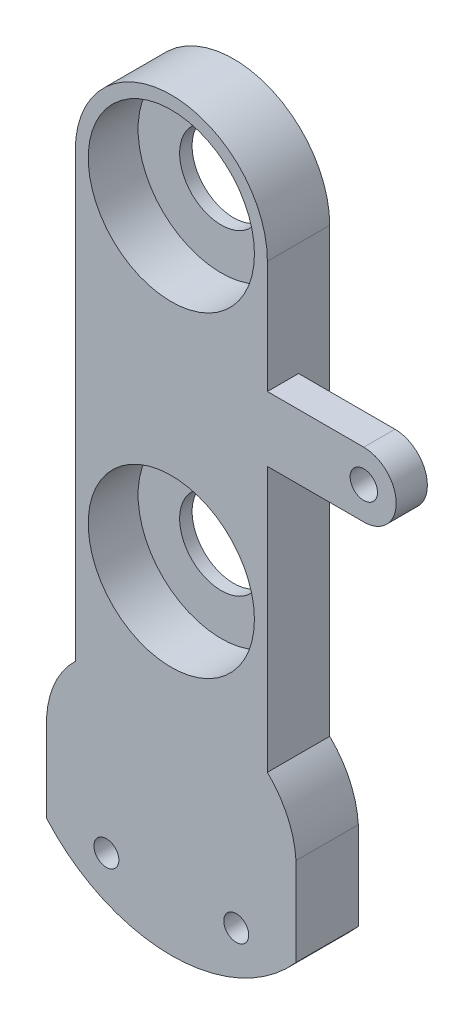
ISO-10303-21;
HEADER;
FILE_DESCRIPTION(('STEP AP214'),'2;1');
FILE_NAME('part.step','',(''),(''),'','','');
FILE_SCHEMA(('AUTOMOTIVE_DESIGN { 1 0 10303 214 1 1 1 1 }'));
ENDSEC;
DATA;
#1=APPLICATION_CONTEXT('core data for automotive mechanical design processes');
#2=APPLICATION_PROTOCOL_DEFINITION('international standard','automotive_design',2000,#1);
#3=PRODUCT_CONTEXT('',#1,'mechanical');
#4=PRODUCT('Part','Part','',(#3));
#5=PRODUCT_RELATED_PRODUCT_CATEGORY('part','',(#4));
#6=PRODUCT_DEFINITION_FORMATION('','',#4);
#7=PRODUCT_DEFINITION_CONTEXT('part definition',#1,'design');
#8=PRODUCT_DEFINITION('design','',#6,#7);
#9=PRODUCT_DEFINITION_SHAPE('','',#8);
#10=(LENGTH_UNIT() NAMED_UNIT(*) SI_UNIT(.MILLI.,.METRE.));
#11=(NAMED_UNIT(*) PLANE_ANGLE_UNIT() SI_UNIT($,.RADIAN.));
#12=(NAMED_UNIT(*) SI_UNIT($,.STERADIAN.) SOLID_ANGLE_UNIT());
#13=UNCERTAINTY_MEASURE_WITH_UNIT(LENGTH_MEASURE(1.E-05),#10,'distance_accuracy_value','');
#14=(GEOMETRIC_REPRESENTATION_CONTEXT(3) GLOBAL_UNCERTAINTY_ASSIGNED_CONTEXT((#13)) GLOBAL_UNIT_ASSIGNED_CONTEXT((#10,
#11,#12)) REPRESENTATION_CONTEXT('',''));
#15=CARTESIAN_POINT('',(0.,0.,0.));
#16=DIRECTION('',(0.,0.,1.));
#17=DIRECTION('',(1.,0.,0.));
#18=AXIS2_PLACEMENT_3D('',#15,#16,#17);
#19=CARTESIAN_POINT('',(76.325635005,99.9564099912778,15.));
#20=DIRECTION('',(0.,-1.,0.));
#21=DIRECTION('',(0.,0.,-1.));
#22=AXIS2_PLACEMENT_3D('',#19,#20,#21);
#23=PLANE('',#22);
#24=DIRECTION('',(0.,0.,-1.));
#25=VECTOR('',#24,1.);
#26=CARTESIAN_POINT('',(53.126816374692,99.9564099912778,15.));
#27=LINE('',#26,#25);
#28=CARTESIAN_POINT('',(53.126816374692,99.9564099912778,15.));
#29=VERTEX_POINT('',#28);
#30=CARTESIAN_POINT('',(53.126816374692,99.9564099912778,7.5));
#31=VERTEX_POINT('',#30);
#32=EDGE_CURVE('E266',#29,#31,#27,.T.);
#33=ORIENTED_EDGE('',*,*,#32,.T.);
#34=DIRECTION('',(-1.,0.,0.));
#35=VECTOR('',#34,1.);
#36=CARTESIAN_POINT('',(22.6023044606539,99.9564099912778,7.5));
#37=LINE('',#36,#35);
#38=CARTESIAN_POINT('',(76.325635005,99.9564099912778,7.5));
#39=VERTEX_POINT('',#38);
#40=EDGE_CURVE('E348',#39,#31,#37,.T.);
#41=ORIENTED_EDGE('',*,*,#40,.F.);
#42=DIRECTION('',(0.,0.,-1.));
#43=VECTOR('',#42,1.);
#44=CARTESIAN_POINT('',(76.325635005,99.9564099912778,15.));
#45=LINE('',#44,#43);
#46=CARTESIAN_POINT('',(76.325635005,99.9564099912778,15.));
#47=VERTEX_POINT('',#46);
#48=EDGE_CURVE('E263',#47,#39,#45,.T.);
#49=ORIENTED_EDGE('',*,*,#48,.F.);
#50=DIRECTION('',(-1.,0.,0.));
#51=VECTOR('',#50,1.);
#52=CARTESIAN_POINT('',(76.325635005,99.9564099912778,15.));
#53=LINE('',#52,#51);
#54=EDGE_CURVE('E335',#47,#29,#53,.T.);
#55=ORIENTED_EDGE('',*,*,#54,.T.);
#56=EDGE_LOOP('',(#33,#41,#49,#55));
#57=FACE_BOUND('',#56,.T.);
#58=ADVANCED_FACE('F123',(#57),#23,.T.);
#59=CARTESIAN_POINT('',(76.325635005,107.753585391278,15.));
#60=DIRECTION('',(0.,0.,-1.));
#61=DIRECTION('',(-1.,0.,0.));
#62=AXIS2_PLACEMENT_3D('',#59,#60,#61);
#63=CYLINDRICAL_SURFACE('',#62,7.7971754);
#64=CARTESIAN_POINT('',(76.325635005,107.753585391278,7.5));
#65=DIRECTION('',(0.,0.,-1.));
#66=DIRECTION('',(-1.,0.,0.));
#67=AXIS2_PLACEMENT_3D('',#64,#65,#66);
#68=CIRCLE('',#67,7.7971754);
#69=CARTESIAN_POINT('',(76.325635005,115.550760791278,7.5));
#70=VERTEX_POINT('',#69);
#71=EDGE_CURVE('E349',#70,#39,#68,.T.);
#72=ORIENTED_EDGE('',*,*,#71,.F.);
#73=DIRECTION('',(0.,0.,-1.));
#74=VECTOR('',#73,1.);
#75=CARTESIAN_POINT('',(76.325635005,115.550760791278,15.));
#76=LINE('',#75,#74);
#77=CARTESIAN_POINT('',(76.325635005,115.550760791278,15.));
#78=VERTEX_POINT('',#77);
#79=EDGE_CURVE('E234',#78,#70,#76,.T.);
#80=ORIENTED_EDGE('',*,*,#79,.F.);
#81=CARTESIAN_POINT('',(76.325635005,107.753585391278,15.));
#82=DIRECTION('',(0.,0.,1.));
#83=DIRECTION('',(1.,0.,0.));
#84=AXIS2_PLACEMENT_3D('',#81,#82,#83);
#85=CIRCLE('',#84,7.7971754);
#86=EDGE_CURVE('E221',#47,#78,#85,.T.);
#87=ORIENTED_EDGE('',*,*,#86,.F.);
#88=ORIENTED_EDGE('',*,*,#48,.T.);
#89=EDGE_LOOP('',(#72,#80,#87,#88));
#90=FACE_BOUND('',#89,.T.);
#91=ADVANCED_FACE('F377',(#90),#63,.T.);
#92=CARTESIAN_POINT('',(76.325635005,115.550760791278,15.));
#93=DIRECTION('',(-0.000300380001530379,-0.999999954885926,0.));
#94=DIRECTION('',(0.999999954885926,-0.00030038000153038,0.));
#95=AXIS2_PLACEMENT_3D('',#92,#93,#94);
#96=PLANE('',#95);
#97=DIRECTION('',(0.999999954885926,-0.00030038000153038,0.));
#98=VECTOR('',#97,1.);
#99=CARTESIAN_POINT('',(22.6310432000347,115.566889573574,7.5));
#100=LINE('',#99,#98);
#101=CARTESIAN_POINT('',(53.126816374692,115.557729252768,7.5));
#102=VERTEX_POINT('',#101);
#103=EDGE_CURVE('E231',#102,#70,#100,.T.);
#104=ORIENTED_EDGE('',*,*,#103,.F.);
#105=DIRECTION('',(0.,0.,-1.));
#106=VECTOR('',#105,1.);
#107=CARTESIAN_POINT('',(53.126816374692,115.557729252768,15.));
#108=LINE('',#107,#106);
#109=CARTESIAN_POINT('',(53.126816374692,115.557729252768,15.));
#110=VERTEX_POINT('',#109);
#111=EDGE_CURVE('E228',#110,#102,#108,.T.);
#112=ORIENTED_EDGE('',*,*,#111,.F.);
#113=DIRECTION('',(-0.999999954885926,0.00030038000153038,0.));
#114=VECTOR('',#113,1.);
#115=CARTESIAN_POINT('',(76.325635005,115.550760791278,15.));
#116=LINE('',#115,#114);
#117=EDGE_CURVE('E213',#78,#110,#116,.T.);
#118=ORIENTED_EDGE('',*,*,#117,.F.);
#119=ORIENTED_EDGE('',*,*,#79,.T.);
#120=EDGE_LOOP('',(#104,#112,#118,#119));
#121=FACE_BOUND('',#120,.T.);
#122=ADVANCED_FACE('F229',(#121),#96,.F.);
#123=CARTESIAN_POINT('',(22.6023044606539,19.892284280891,15.));
#124=DIRECTION('',(0.,0.,-1.));
#125=DIRECTION('',(-1.,0.,0.));
#126=AXIS2_PLACEMENT_3D('',#123,#124,#125);
#127=PLANE('',#126);
#128=CARTESIAN_POINT('',(76.325635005,107.753585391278,15.));
#129=DIRECTION('',(0.,0.,-1.));
#130=DIRECTION('',(-1.,0.,0.));
#131=AXIS2_PLACEMENT_3D('',#128,#129,#130);
#132=CIRCLE('',#131,3.3);
#133=CARTESIAN_POINT('',(73.025635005,107.753585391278,15.));
#134=VERTEX_POINT('',#133);
#135=EDGE_CURVE('E354',#134,#134,#132,.T.);
#136=ORIENTED_EDGE('',*,*,#135,.T.);
#137=EDGE_LOOP('',(#136));
#138=FACE_BOUND('',#137,.T.);
#139=CARTESIAN_POINT('',(30.006144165,142.699071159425,15.));
#140=DIRECTION('',(0.,0.,1.));
#141=DIRECTION('',(1.,0.,0.));
#142=AXIS2_PLACEMENT_3D('',#139,#140,#141);
#143=CIRCLE('',#142,20.);
#144=CARTESIAN_POINT('',(50.006144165,142.699071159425,15.));
#145=VERTEX_POINT('',#144);
#146=EDGE_CURVE('E302',#145,#145,#143,.T.);
#147=ORIENTED_EDGE('',*,*,#146,.F.);
#148=EDGE_LOOP('',(#147));
#149=FACE_BOUND('',#148,.T.);
#150=CARTESIAN_POINT('',(30.006144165,66.4990711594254,15.));
#151=DIRECTION('',(0.,0.,1.));
#152=DIRECTION('',(1.,0.,0.));
#153=AXIS2_PLACEMENT_3D('',#150,#151,#152);
#154=CIRCLE('',#153,20.);
#155=CARTESIAN_POINT('',(50.006144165,66.4990711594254,15.));
#156=VERTEX_POINT('',#155);
#157=EDGE_CURVE('E305',#156,#156,#154,.T.);
#158=ORIENTED_EDGE('',*,*,#157,.F.);
#159=EDGE_LOOP('',(#158));
#160=FACE_BOUND('',#159,.T.);
#161=CARTESIAN_POINT('',(45.631144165,0.,15.));
#162=DIRECTION('',(0.,0.,-1.));
#163=DIRECTION('',(-1.,0.,0.));
#164=AXIS2_PLACEMENT_3D('',#161,#162,#163);
#165=CIRCLE('',#164,2.99999999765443);
#166=CARTESIAN_POINT('',(42.6311441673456,0.,15.));
#167=VERTEX_POINT('',#166);
#168=EDGE_CURVE('E310',#167,#167,#165,.T.);
#169=ORIENTED_EDGE('',*,*,#168,.T.);
#170=EDGE_LOOP('',(#169));
#171=FACE_BOUND('',#170,.T.);
#172=DIRECTION('',(0.,-1.,0.));
#173=VECTOR('',#172,1.);
#174=CARTESIAN_POINT('',(6.88547195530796,142.699071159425,15.));
#175=LINE('',#174,#173);
#176=CARTESIAN_POINT('',(6.88547195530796,142.699071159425,15.));
#177=VERTEX_POINT('',#176);
#178=CARTESIAN_POINT('',(6.88547195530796,36.1909692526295,15.));
#179=VERTEX_POINT('',#178);
#180=EDGE_CURVE('E184',#177,#179,#175,.T.);
#181=ORIENTED_EDGE('',*,*,#180,.T.);
#182=CARTESIAN_POINT('',(22.6023044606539,19.892284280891,15.));
#183=DIRECTION('',(0.,0.,-1.));
#184=DIRECTION('',(-1.,0.,0.));
#185=AXIS2_PLACEMENT_3D('',#182,#183,#184);
#186=CIRCLE('',#185,22.642127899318);
#187=CARTESIAN_POINT('',(0.,21.2345915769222,15.));
#188=VERTEX_POINT('',#187);
#189=EDGE_CURVE('E321',#188,#179,#186,.T.);
#190=ORIENTED_EDGE('',*,*,#189,.F.);
#191=DIRECTION('',(0.,1.,0.));
#192=VECTOR('',#191,1.);
#193=CARTESIAN_POINT('',(0.,0.,15.));
#194=LINE('',#193,#192);
#195=CARTESIAN_POINT('',(0.,0.,15.));
#196=VERTEX_POINT('',#195);
#197=EDGE_CURVE('E324',#196,#188,#194,.T.);
#198=ORIENTED_EDGE('',*,*,#197,.F.);
#199=CARTESIAN_POINT('',(30.006144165,26.4505446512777,15.));
#200=DIRECTION('',(0.,0.,1.));
#201=DIRECTION('',(1.,0.,0.));
#202=AXIS2_PLACEMENT_3D('',#199,#200,#201);
#203=CIRCLE('',#202,40.);
#204=CARTESIAN_POINT('',(60.01228833,0.,15.));
#205=VERTEX_POINT('',#204);
#206=EDGE_CURVE('E327',#196,#205,#203,.T.);
#207=ORIENTED_EDGE('',*,*,#206,.T.);
#208=DIRECTION('',(0.,1.,0.));
#209=VECTOR('',#208,1.);
#210=CARTESIAN_POINT('',(60.01228833,0.,15.));
#211=LINE('',#210,#209);
#212=CARTESIAN_POINT('',(60.01228833,21.2345915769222,15.));
#213=VERTEX_POINT('',#212);
#214=EDGE_CURVE('E329',#205,#213,#211,.T.);
#215=ORIENTED_EDGE('',*,*,#214,.T.);
#216=CARTESIAN_POINT('',(37.4099838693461,19.892284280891,15.));
#217=DIRECTION('',(0.,0.,1.));
#218=DIRECTION('',(1.,0.,0.));
#219=AXIS2_PLACEMENT_3D('',#216,#217,#218);
#220=CIRCLE('',#219,22.642127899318);
#221=CARTESIAN_POINT('',(53.126816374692,36.1909692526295,15.));
#222=VERTEX_POINT('',#221);
#223=EDGE_CURVE('E331',#213,#222,#220,.T.);
#224=ORIENTED_EDGE('',*,*,#223,.T.);
#225=DIRECTION('',(0.,1.,0.));
#226=VECTOR('',#225,1.);
#227=CARTESIAN_POINT('',(53.126816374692,36.1909692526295,15.));
#228=LINE('',#227,#226);
#229=EDGE_CURVE('E333',#222,#29,#228,.T.);
#230=ORIENTED_EDGE('',*,*,#229,.T.);
#231=ORIENTED_EDGE('',*,*,#54,.F.);
#232=ORIENTED_EDGE('',*,*,#86,.T.);
#233=ORIENTED_EDGE('',*,*,#117,.T.);
#234=DIRECTION('',(0.,1.,0.));
#235=VECTOR('',#234,1.);
#236=CARTESIAN_POINT('',(53.126816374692,115.557729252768,15.));
#237=LINE('',#236,#235);
#238=CARTESIAN_POINT('',(53.126816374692,142.699071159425,15.));
#239=VERTEX_POINT('',#238);
#240=EDGE_CURVE('E218',#110,#239,#237,.T.);
#241=ORIENTED_EDGE('',*,*,#240,.T.);
#242=CARTESIAN_POINT('',(30.006144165,142.699071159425,15.));
#243=DIRECTION('',(0.,0.,-1.));
#244=DIRECTION('',(-1.,0.,0.));
#245=AXIS2_PLACEMENT_3D('',#242,#243,#244);
#246=CIRCLE('',#245,23.120672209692);
#247=EDGE_CURVE('E237',#177,#239,#246,.T.);
#248=ORIENTED_EDGE('',*,*,#247,.F.);
#249=EDGE_LOOP('',(#181,#190,#198,#207,#215,#224,#230,#231,#232,#233,#241,#248));
#250=FACE_BOUND('',#249,.T.);
#251=CARTESIAN_POINT('',(14.381144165,0.,15.));
#252=DIRECTION('',(0.,0.,1.));
#253=DIRECTION('',(1.,0.,0.));
#254=AXIS2_PLACEMENT_3D('',#251,#252,#253);
#255=CIRCLE('',#254,2.99999999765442);
#256=CARTESIAN_POINT('',(17.3811441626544,0.,15.));
#257=VERTEX_POINT('',#256);
#258=EDGE_CURVE('E244',#257,#257,#255,.T.);
#259=ORIENTED_EDGE('',*,*,#258,.F.);
#260=EDGE_LOOP('',(#259));
#261=FACE_BOUND('',#260,.T.);
#262=ADVANCED_FACE('F215',(#138,#149,#160,#171,#250,#261),#127,.F.);
#263=CARTESIAN_POINT('',(22.6023044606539,19.892284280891,0.));
#264=DIRECTION('',(0.,0.,-1.));
#265=DIRECTION('',(-1.,0.,0.));
#266=AXIS2_PLACEMENT_3D('',#263,#264,#265);
#267=PLANE('',#266);
#268=DIRECTION('',(0.,1.,0.));
#269=VECTOR('',#268,1.);
#270=CARTESIAN_POINT('',(53.126816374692,115.557729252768,0.));
#271=LINE('',#270,#269);
#272=CARTESIAN_POINT('',(53.126816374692,36.1909692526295,0.));
#273=VERTEX_POINT('',#272);
#274=CARTESIAN_POINT('',(53.126816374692,142.699071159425,0.));
#275=VERTEX_POINT('',#274);
#276=EDGE_CURVE('E256',#273,#275,#271,.T.);
#277=ORIENTED_EDGE('',*,*,#276,.F.);
#278=CARTESIAN_POINT('',(37.4099838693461,19.892284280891,0.));
#279=DIRECTION('',(0.,0.,1.));
#280=DIRECTION('',(1.,0.,0.));
#281=AXIS2_PLACEMENT_3D('',#278,#279,#280);
#282=CIRCLE('',#281,22.642127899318);
#283=CARTESIAN_POINT('',(60.01228833,21.2345915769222,0.));
#284=VERTEX_POINT('',#283);
#285=EDGE_CURVE('E253',#284,#273,#282,.T.);
#286=ORIENTED_EDGE('',*,*,#285,.F.);
#287=DIRECTION('',(0.,1.,0.));
#288=VECTOR('',#287,1.);
#289=CARTESIAN_POINT('',(60.01228833,0.,0.));
#290=LINE('',#289,#288);
#291=CARTESIAN_POINT('',(60.01228833,0.,0.));
#292=VERTEX_POINT('',#291);
#293=EDGE_CURVE('E251',#292,#284,#290,.T.);
#294=ORIENTED_EDGE('',*,*,#293,.F.);
#295=CARTESIAN_POINT('',(30.006144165,26.4505446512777,0.));
#296=DIRECTION('',(0.,0.,1.));
#297=DIRECTION('',(1.,0.,0.));
#298=AXIS2_PLACEMENT_3D('',#295,#296,#297);
#299=CIRCLE('',#298,40.);
#300=CARTESIAN_POINT('',(0.,0.,0.));
#301=VERTEX_POINT('',#300);
#302=EDGE_CURVE('E249',#301,#292,#299,.T.);
#303=ORIENTED_EDGE('',*,*,#302,.F.);
#304=DIRECTION('',(0.,1.,0.));
#305=VECTOR('',#304,1.);
#306=CARTESIAN_POINT('',(0.,0.,0.));
#307=LINE('',#306,#305);
#308=CARTESIAN_POINT('',(0.,21.2345915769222,0.));
#309=VERTEX_POINT('',#308);
#310=EDGE_CURVE('E246',#301,#309,#307,.T.);
#311=ORIENTED_EDGE('',*,*,#310,.T.);
#312=CARTESIAN_POINT('',(22.6023044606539,19.892284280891,0.));
#313=DIRECTION('',(0.,0.,-1.));
#314=DIRECTION('',(-1.,0.,0.));
#315=AXIS2_PLACEMENT_3D('',#312,#313,#314);
#316=CIRCLE('',#315,22.642127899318);
#317=CARTESIAN_POINT('',(6.88547195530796,36.1909692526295,0.));
#318=VERTEX_POINT('',#317);
#319=EDGE_CURVE('E243',#309,#318,#316,.T.);
#320=ORIENTED_EDGE('',*,*,#319,.T.);
#321=DIRECTION('',(0.,-1.,0.));
#322=VECTOR('',#321,1.);
#323=CARTESIAN_POINT('',(6.88547195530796,113.682673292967,0.));
#324=LINE('',#323,#322);
#325=CARTESIAN_POINT('',(6.88547195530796,142.699071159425,0.));
#326=VERTEX_POINT('',#325);
#327=EDGE_CURVE('E177',#326,#318,#324,.T.);
#328=ORIENTED_EDGE('',*,*,#327,.F.);
#329=CARTESIAN_POINT('',(30.006144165,142.699071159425,0.));
#330=DIRECTION('',(0.,0.,-1.));
#331=DIRECTION('',(-1.,0.,0.));
#332=AXIS2_PLACEMENT_3D('',#329,#330,#331);
#333=CIRCLE('',#332,23.120672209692);
#334=EDGE_CURVE('E258',#326,#275,#333,.T.);
#335=ORIENTED_EDGE('',*,*,#334,.T.);
#336=EDGE_LOOP('',(#277,#286,#294,#303,#311,#320,#328,#335));
#337=FACE_BOUND('',#336,.T.);
#338=CARTESIAN_POINT('',(30.006144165,142.699071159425,0.));
#339=DIRECTION('',(0.,0.,1.));
#340=DIRECTION('',(1.,0.,0.));
#341=AXIS2_PLACEMENT_3D('',#338,#339,#340);
#342=CIRCLE('',#341,10.);
#343=CARTESIAN_POINT('',(40.006144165,142.699071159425,0.));
#344=VERTEX_POINT('',#343);
#345=EDGE_CURVE('E282',#344,#344,#342,.T.);
#346=ORIENTED_EDGE('',*,*,#345,.T.);
#347=EDGE_LOOP('',(#346));
#348=FACE_BOUND('',#347,.T.);
#349=CARTESIAN_POINT('',(30.006144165,66.4990711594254,0.));
#350=DIRECTION('',(0.,0.,1.));
#351=DIRECTION('',(1.,0.,0.));
#352=AXIS2_PLACEMENT_3D('',#349,#350,#351);
#353=CIRCLE('',#352,10.);
#354=CARTESIAN_POINT('',(40.006144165,66.4990711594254,0.));
#355=VERTEX_POINT('',#354);
#356=EDGE_CURVE('E288',#355,#355,#353,.T.);
#357=ORIENTED_EDGE('',*,*,#356,.T.);
#358=EDGE_LOOP('',(#357));
#359=FACE_BOUND('',#358,.T.);
#360=CARTESIAN_POINT('',(45.631144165,0.,0.));
#361=DIRECTION('',(0.,0.,-1.));
#362=DIRECTION('',(-1.,0.,0.));
#363=AXIS2_PLACEMENT_3D('',#360,#361,#362);
#364=CIRCLE('',#363,2.99999999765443);
#365=CARTESIAN_POINT('',(42.6311441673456,0.,0.));
#366=VERTEX_POINT('',#365);
#367=EDGE_CURVE('E301',#366,#366,#364,.T.);
#368=ORIENTED_EDGE('',*,*,#367,.F.);
#369=EDGE_LOOP('',(#368));
#370=FACE_BOUND('',#369,.T.);
#371=CARTESIAN_POINT('',(14.381144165,0.,0.));
#372=DIRECTION('',(0.,0.,1.));
#373=DIRECTION('',(1.,0.,0.));
#374=AXIS2_PLACEMENT_3D('',#371,#372,#373);
#375=CIRCLE('',#374,2.99999999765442);
#376=CARTESIAN_POINT('',(17.3811441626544,0.,0.));
#377=VERTEX_POINT('',#376);
#378=EDGE_CURVE('E313',#377,#377,#375,.T.);
#379=ORIENTED_EDGE('',*,*,#378,.T.);
#380=EDGE_LOOP('',(#379));
#381=FACE_BOUND('',#380,.T.);
#382=ADVANCED_FACE('F410',(#337,#348,#359,#370,#381),#267,.T.);
#383=CARTESIAN_POINT('',(6.88547195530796,113.682673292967,15.));
#384=DIRECTION('',(1.,0.,0.));
#385=DIRECTION('',(0.,0.,-1.));
#386=AXIS2_PLACEMENT_3D('',#383,#384,#385);
#387=PLANE('',#386);
#388=ORIENTED_EDGE('',*,*,#327,.T.);
#389=DIRECTION('',(0.,0.,-1.));
#390=VECTOR('',#389,1.);
#391=CARTESIAN_POINT('',(6.88547195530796,36.1909692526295,15.));
#392=LINE('',#391,#390);
#393=EDGE_CURVE('E12',#179,#318,#392,.T.);
#394=ORIENTED_EDGE('',*,*,#393,.F.);
#395=ORIENTED_EDGE('',*,*,#180,.F.);
#396=DIRECTION('',(0.,0.,-1.));
#397=VECTOR('',#396,1.);
#398=CARTESIAN_POINT('',(6.88547195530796,142.699071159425,15.));
#399=LINE('',#398,#397);
#400=EDGE_CURVE('E142',#177,#326,#399,.T.);
#401=ORIENTED_EDGE('',*,*,#400,.T.);
#402=EDGE_LOOP('',(#388,#394,#395,#401));
#403=FACE_BOUND('',#402,.T.);
#404=ADVANCED_FACE('F125',(#403),#387,.F.);
#405=CARTESIAN_POINT('',(22.6023044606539,19.892284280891,15.));
#406=DIRECTION('',(0.,0.,-1.));
#407=DIRECTION('',(-1.,0.,0.));
#408=AXIS2_PLACEMENT_3D('',#405,#406,#407);
#409=CYLINDRICAL_SURFACE('',#408,22.642127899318);
#410=ORIENTED_EDGE('',*,*,#319,.F.);
#411=DIRECTION('',(0.,0.,-1.));
#412=VECTOR('',#411,1.);
#413=CARTESIAN_POINT('',(0.,21.2345915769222,15.));
#414=LINE('',#413,#412);
#415=EDGE_CURVE('E133',#188,#309,#414,.T.);
#416=ORIENTED_EDGE('',*,*,#415,.F.);
#417=ORIENTED_EDGE('',*,*,#189,.T.);
#418=ORIENTED_EDGE('',*,*,#393,.T.);
#419=EDGE_LOOP('',(#410,#416,#417,#418));
#420=FACE_BOUND('',#419,.T.);
#421=ADVANCED_FACE('F403',(#420),#409,.T.);
#422=CARTESIAN_POINT('',(0.,0.,15.));
#423=DIRECTION('',(-1.,0.,0.));
#424=DIRECTION('',(0.,-1.,0.));
#425=AXIS2_PLACEMENT_3D('',#422,#423,#424);
#426=PLANE('',#425);
#427=ORIENTED_EDGE('',*,*,#310,.F.);
#428=DIRECTION('',(0.,0.,-1.));
#429=VECTOR('',#428,1.);
#430=CARTESIAN_POINT('',(0.,0.,15.));
#431=LINE('',#430,#429);
#432=EDGE_CURVE('E278',#196,#301,#431,.T.);
#433=ORIENTED_EDGE('',*,*,#432,.F.);
#434=ORIENTED_EDGE('',*,*,#197,.T.);
#435=ORIENTED_EDGE('',*,*,#415,.T.);
#436=EDGE_LOOP('',(#427,#433,#434,#435));
#437=FACE_BOUND('',#436,.T.);
#438=ADVANCED_FACE('F400',(#437),#426,.T.);
#439=CARTESIAN_POINT('',(30.006144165,26.4505446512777,15.));
#440=DIRECTION('',(0.,0.,-1.));
#441=DIRECTION('',(-1.,0.,0.));
#442=AXIS2_PLACEMENT_3D('',#439,#440,#441);
#443=CYLINDRICAL_SURFACE('',#442,40.);
#444=ORIENTED_EDGE('',*,*,#302,.T.);
#445=DIRECTION('',(0.,0.,-1.));
#446=VECTOR('',#445,1.);
#447=CARTESIAN_POINT('',(60.01228833,0.,15.));
#448=LINE('',#447,#446);
#449=EDGE_CURVE('E275',#205,#292,#448,.T.);
#450=ORIENTED_EDGE('',*,*,#449,.F.);
#451=ORIENTED_EDGE('',*,*,#206,.F.);
#452=ORIENTED_EDGE('',*,*,#432,.T.);
#453=EDGE_LOOP('',(#444,#450,#451,#452));
#454=FACE_BOUND('',#453,.T.);
#455=ADVANCED_FACE('F396',(#454),#443,.T.);
#456=CARTESIAN_POINT('',(60.01228833,0.,15.));
#457=DIRECTION('',(-1.,0.,0.));
#458=DIRECTION('',(0.,0.,1.));
#459=AXIS2_PLACEMENT_3D('',#456,#457,#458);
#460=PLANE('',#459);
#461=ORIENTED_EDGE('',*,*,#293,.T.);
#462=DIRECTION('',(0.,0.,-1.));
#463=VECTOR('',#462,1.);
#464=CARTESIAN_POINT('',(60.01228833,21.2345915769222,15.));
#465=LINE('',#464,#463);
#466=EDGE_CURVE('E272',#213,#284,#465,.T.);
#467=ORIENTED_EDGE('',*,*,#466,.F.);
#468=ORIENTED_EDGE('',*,*,#214,.F.);
#469=ORIENTED_EDGE('',*,*,#449,.T.);
#470=EDGE_LOOP('',(#461,#467,#468,#469));
#471=FACE_BOUND('',#470,.T.);
#472=ADVANCED_FACE('F392',(#471),#460,.F.);
#473=CARTESIAN_POINT('',(37.4099838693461,19.892284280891,15.));
#474=DIRECTION('',(0.,0.,-1.));
#475=DIRECTION('',(-1.,0.,0.));
#476=AXIS2_PLACEMENT_3D('',#473,#474,#475);
#477=CYLINDRICAL_SURFACE('',#476,22.642127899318);
#478=ORIENTED_EDGE('',*,*,#285,.T.);
#479=DIRECTION('',(0.,0.,-1.));
#480=VECTOR('',#479,1.);
#481=CARTESIAN_POINT('',(53.126816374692,36.1909692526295,15.));
#482=LINE('',#481,#480);
#483=EDGE_CURVE('E269',#222,#273,#482,.T.);
#484=ORIENTED_EDGE('',*,*,#483,.F.);
#485=ORIENTED_EDGE('',*,*,#223,.F.);
#486=ORIENTED_EDGE('',*,*,#466,.T.);
#487=EDGE_LOOP('',(#478,#484,#485,#486));
#488=FACE_BOUND('',#487,.T.);
#489=ADVANCED_FACE('F389',(#488),#477,.T.);
#490=CARTESIAN_POINT('',(53.126816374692,115.557729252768,15.));
#491=DIRECTION('',(-1.,0.,0.));
#492=DIRECTION('',(0.,-1.,0.));
#493=AXIS2_PLACEMENT_3D('',#490,#491,#492);
#494=PLANE('',#493);
#495=ORIENTED_EDGE('',*,*,#276,.T.);
#496=DIRECTION('',(0.,0.,-1.));
#497=VECTOR('',#496,1.);
#498=CARTESIAN_POINT('',(53.126816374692,142.699071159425,15.));
#499=LINE('',#498,#497);
#500=EDGE_CURVE('E169',#239,#275,#499,.T.);
#501=ORIENTED_EDGE('',*,*,#500,.F.);
#502=ORIENTED_EDGE('',*,*,#240,.F.);
#503=ORIENTED_EDGE('',*,*,#111,.T.);
#504=DIRECTION('',(0.,1.,0.));
#505=VECTOR('',#504,1.);
#506=CARTESIAN_POINT('',(53.126816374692,19.892284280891,7.5));
#507=LINE('',#506,#505);
#508=EDGE_CURVE('E293',#31,#102,#507,.T.);
#509=ORIENTED_EDGE('',*,*,#508,.F.);
#510=ORIENTED_EDGE('',*,*,#32,.F.);
#511=ORIENTED_EDGE('',*,*,#229,.F.);
#512=ORIENTED_EDGE('',*,*,#483,.T.);
#513=EDGE_LOOP('',(#495,#501,#502,#503,#509,#510,#511,#512));
#514=FACE_BOUND('',#513,.T.);
#515=ADVANCED_FACE('F236',(#514),#494,.F.);
#516=CARTESIAN_POINT('',(30.006144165,142.699071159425,15.));
#517=DIRECTION('',(0.,0.,-1.));
#518=DIRECTION('',(-1.,0.,0.));
#519=AXIS2_PLACEMENT_3D('',#516,#517,#518);
#520=CYLINDRICAL_SURFACE('',#519,23.120672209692);
#521=ORIENTED_EDGE('',*,*,#334,.F.);
#522=ORIENTED_EDGE('',*,*,#400,.F.);
#523=ORIENTED_EDGE('',*,*,#247,.T.);
#524=ORIENTED_EDGE('',*,*,#500,.T.);
#525=EDGE_LOOP('',(#521,#522,#523,#524));
#526=FACE_BOUND('',#525,.T.);
#527=ADVANCED_FACE('F422',(#526),#520,.T.);
#528=CARTESIAN_POINT('',(14.381144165,0.,15.));
#529=DIRECTION('',(0.,0.,-1.));
#530=DIRECTION('',(-1.,0.,0.));
#531=AXIS2_PLACEMENT_3D('',#528,#529,#530);
#532=CYLINDRICAL_SURFACE('',#531,2.99999999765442);
#533=ORIENTED_EDGE('',*,*,#258,.T.);
#534=EDGE_LOOP('',(#533));
#535=FACE_BOUND('',#534,.T.);
#536=ORIENTED_EDGE('',*,*,#378,.F.);
#537=EDGE_LOOP('',(#536));
#538=FACE_BOUND('',#537,.T.);
#539=ADVANCED_FACE('F424',(#535,#538),#532,.F.);
#540=CARTESIAN_POINT('',(45.631144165,0.,15.));
#541=DIRECTION('',(0.,0.,-1.));
#542=DIRECTION('',(-1.,0.,0.));
#543=AXIS2_PLACEMENT_3D('',#540,#541,#542);
#544=CYLINDRICAL_SURFACE('',#543,2.99999999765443);
#545=ORIENTED_EDGE('',*,*,#168,.F.);
#546=EDGE_LOOP('',(#545));
#547=FACE_BOUND('',#546,.T.);
#548=ORIENTED_EDGE('',*,*,#367,.T.);
#549=EDGE_LOOP('',(#548));
#550=FACE_BOUND('',#549,.T.);
#551=ADVANCED_FACE('F429',(#547,#550),#544,.F.);
#552=CARTESIAN_POINT('',(30.006144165,66.4990711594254,3.));
#553=DIRECTION('',(0.,0.,1.));
#554=DIRECTION('',(1.,0.,0.));
#555=AXIS2_PLACEMENT_3D('',#552,#553,#554);
#556=CYLINDRICAL_SURFACE('',#555,20.);
#557=CARTESIAN_POINT('',(30.006144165,66.4990711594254,3.));
#558=DIRECTION('',(0.,0.,1.));
#559=DIRECTION('',(1.,0.,0.));
#560=AXIS2_PLACEMENT_3D('',#557,#558,#559);
#561=CIRCLE('',#560,20.);
#562=CARTESIAN_POINT('',(50.006144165,66.4990711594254,3.));
#563=VERTEX_POINT('',#562);
#564=EDGE_CURVE('E286',#563,#563,#561,.T.);
#565=ORIENTED_EDGE('',*,*,#564,.F.);
#566=EDGE_LOOP('',(#565));
#567=FACE_BOUND('',#566,.T.);
#568=ORIENTED_EDGE('',*,*,#157,.T.);
#569=EDGE_LOOP('',(#568));
#570=FACE_BOUND('',#569,.T.);
#571=ADVANCED_FACE('F440',(#567,#570),#556,.F.);
#572=CARTESIAN_POINT('',(30.006144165,66.4990711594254,3.));
#573=DIRECTION('',(0.,0.,1.));
#574=DIRECTION('',(1.,0.,0.));
#575=AXIS2_PLACEMENT_3D('',#572,#573,#574);
#576=PLANE('',#575);
#577=CARTESIAN_POINT('',(30.006144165,66.4990711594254,3.));
#578=DIRECTION('',(0.,0.,1.));
#579=DIRECTION('',(1.,0.,0.));
#580=AXIS2_PLACEMENT_3D('',#577,#578,#579);
#581=CIRCLE('',#580,10.);
#582=CARTESIAN_POINT('',(40.006144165,66.4990711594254,3.));
#583=VERTEX_POINT('',#582);
#584=EDGE_CURVE('E127',#583,#583,#581,.T.);
#585=ORIENTED_EDGE('',*,*,#584,.F.);
#586=EDGE_LOOP('',(#585));
#587=FACE_BOUND('',#586,.T.);
#588=ORIENTED_EDGE('',*,*,#564,.T.);
#589=EDGE_LOOP('',(#588));
#590=FACE_BOUND('',#589,.T.);
#591=ADVANCED_FACE('F442',(#587,#590),#576,.T.);
#592=CARTESIAN_POINT('',(30.006144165,142.699071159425,3.));
#593=DIRECTION('',(0.,0.,1.));
#594=DIRECTION('',(1.,0.,0.));
#595=AXIS2_PLACEMENT_3D('',#592,#593,#594);
#596=CYLINDRICAL_SURFACE('',#595,20.);
#597=CARTESIAN_POINT('',(30.006144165,142.699071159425,3.));
#598=DIRECTION('',(0.,0.,1.));
#599=DIRECTION('',(1.,0.,0.));
#600=AXIS2_PLACEMENT_3D('',#597,#598,#599);
#601=CIRCLE('',#600,20.);
#602=CARTESIAN_POINT('',(50.006144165,142.699071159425,3.));
#603=VERTEX_POINT('',#602);
#604=EDGE_CURVE('E298',#603,#603,#601,.T.);
#605=ORIENTED_EDGE('',*,*,#604,.F.);
#606=EDGE_LOOP('',(#605));
#607=FACE_BOUND('',#606,.T.);
#608=ORIENTED_EDGE('',*,*,#146,.T.);
#609=EDGE_LOOP('',(#608));
#610=FACE_BOUND('',#609,.T.);
#611=ADVANCED_FACE('F445',(#607,#610),#596,.F.);
#612=CARTESIAN_POINT('',(30.006144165,142.699071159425,3.));
#613=DIRECTION('',(0.,0.,1.));
#614=DIRECTION('',(1.,0.,0.));
#615=AXIS2_PLACEMENT_3D('',#612,#613,#614);
#616=PLANE('',#615);
#617=CARTESIAN_POINT('',(30.006144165,142.699071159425,3.));
#618=DIRECTION('',(0.,0.,1.));
#619=DIRECTION('',(1.,0.,0.));
#620=AXIS2_PLACEMENT_3D('',#617,#618,#619);
#621=CIRCLE('',#620,10.);
#622=CARTESIAN_POINT('',(40.006144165,142.699071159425,3.));
#623=VERTEX_POINT('',#622);
#624=EDGE_CURVE('E280',#623,#623,#621,.T.);
#625=ORIENTED_EDGE('',*,*,#624,.F.);
#626=EDGE_LOOP('',(#625));
#627=FACE_BOUND('',#626,.T.);
#628=ORIENTED_EDGE('',*,*,#604,.T.);
#629=EDGE_LOOP('',(#628));
#630=FACE_BOUND('',#629,.T.);
#631=ADVANCED_FACE('F452',(#627,#630),#616,.T.);
#632=CARTESIAN_POINT('',(30.006144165,142.699071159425,0.));
#633=DIRECTION('',(0.,0.,1.));
#634=DIRECTION('',(1.,0.,0.));
#635=AXIS2_PLACEMENT_3D('',#632,#633,#634);
#636=CYLINDRICAL_SURFACE('',#635,10.);
#637=ORIENTED_EDGE('',*,*,#624,.T.);
#638=EDGE_LOOP('',(#637));
#639=FACE_BOUND('',#638,.T.);
#640=ORIENTED_EDGE('',*,*,#345,.F.);
#641=EDGE_LOOP('',(#640));
#642=FACE_BOUND('',#641,.T.);
#643=ADVANCED_FACE('F456',(#639,#642),#636,.F.);
#644=CARTESIAN_POINT('',(30.006144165,66.4990711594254,0.));
#645=DIRECTION('',(0.,0.,1.));
#646=DIRECTION('',(1.,0.,0.));
#647=AXIS2_PLACEMENT_3D('',#644,#645,#646);
#648=CYLINDRICAL_SURFACE('',#647,10.);
#649=ORIENTED_EDGE('',*,*,#584,.T.);
#650=EDGE_LOOP('',(#649));
#651=FACE_BOUND('',#650,.T.);
#652=ORIENTED_EDGE('',*,*,#356,.F.);
#653=EDGE_LOOP('',(#652));
#654=FACE_BOUND('',#653,.T.);
#655=ADVANCED_FACE('F371',(#651,#654),#648,.F.);
#656=CARTESIAN_POINT('',(76.325635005,107.753585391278,7.5));
#657=DIRECTION('',(0.,0.,-1.));
#658=DIRECTION('',(-1.,0.,0.));
#659=AXIS2_PLACEMENT_3D('',#656,#657,#658);
#660=PLANE('',#659);
#661=CARTESIAN_POINT('',(76.325635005,107.753585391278,7.5));
#662=DIRECTION('',(0.,0.,-1.));
#663=DIRECTION('',(-1.,0.,0.));
#664=AXIS2_PLACEMENT_3D('',#661,#662,#663);
#665=CIRCLE('',#664,3.3);
#666=CARTESIAN_POINT('',(73.025635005,107.753585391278,7.5));
#667=VERTEX_POINT('',#666);
#668=EDGE_CURVE('E355',#667,#667,#665,.T.);
#669=ORIENTED_EDGE('',*,*,#668,.F.);
#670=EDGE_LOOP('',(#669));
#671=FACE_BOUND('',#670,.T.);
#672=ORIENTED_EDGE('',*,*,#103,.T.);
#673=ORIENTED_EDGE('',*,*,#71,.T.);
#674=ORIENTED_EDGE('',*,*,#40,.T.);
#675=ORIENTED_EDGE('',*,*,#508,.T.);
#676=EDGE_LOOP('',(#672,#673,#674,#675));
#677=FACE_BOUND('',#676,.T.);
#678=ADVANCED_FACE('F366',(#671,#677),#660,.T.);
#679=CARTESIAN_POINT('',(76.325635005,107.753585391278,15.));
#680=DIRECTION('',(0.,0.,-1.));
#681=DIRECTION('',(-1.,0.,0.));
#682=AXIS2_PLACEMENT_3D('',#679,#680,#681);
#683=CYLINDRICAL_SURFACE('',#682,3.3);
#684=ORIENTED_EDGE('',*,*,#135,.F.);
#685=EDGE_LOOP('',(#684));
#686=FACE_BOUND('',#685,.T.);
#687=ORIENTED_EDGE('',*,*,#668,.T.);
#688=EDGE_LOOP('',(#687));
#689=FACE_BOUND('',#688,.T.);
#690=ADVANCED_FACE('F363',(#686,#689),#683,.F.);
#691=CLOSED_SHELL('',(#58,#91,#122,#262,#382,#404,#421,#438,#455,#472,#489,#515,#527,#539,#551,
#571,#591,#611,#631,#643,#655,#678,#690));
#692=MANIFOLD_SOLID_BREP('B2',#691);
#693=ADVANCED_BREP_SHAPE_REPRESENTATION('',(#18,#692),#14);
#694=SHAPE_DEFINITION_REPRESENTATION(#9,#693);
ENDSEC;
END-ISO-10303-21;
